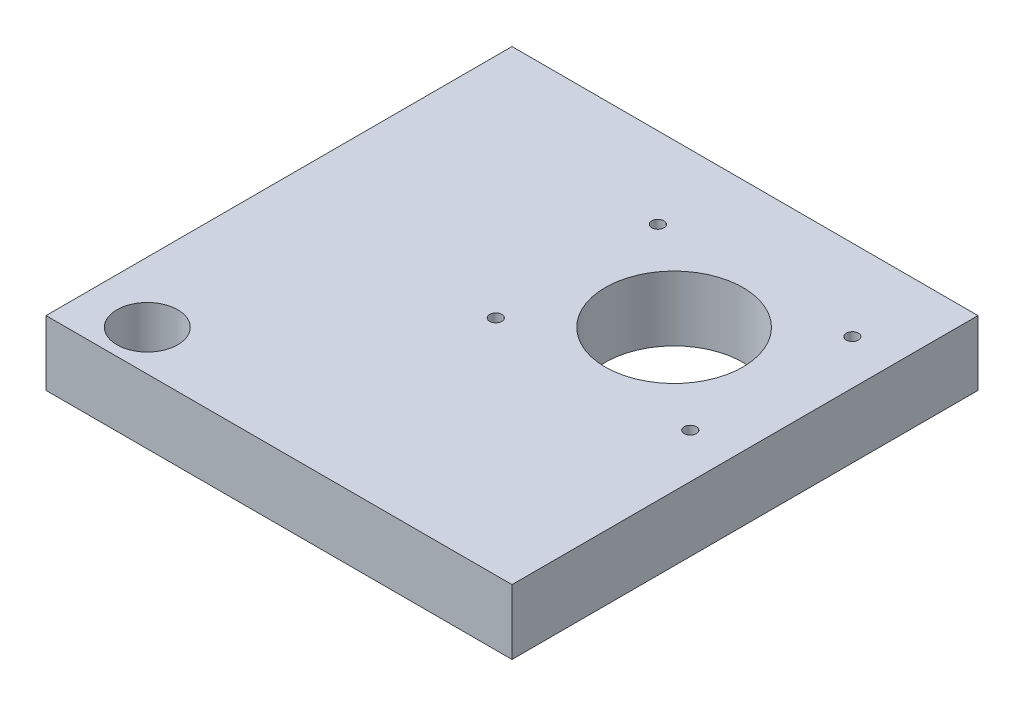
ISO-10303-21;
HEADER;
FILE_DESCRIPTION(('STEP AP214'),'2;1');
FILE_NAME('part.step','',(''),(''),'','','');
FILE_SCHEMA(('AUTOMOTIVE_DESIGN { 1 0 10303 214 1 1 1 1 }'));
ENDSEC;
DATA;
#1=APPLICATION_CONTEXT('core data for automotive mechanical design processes');
#2=APPLICATION_PROTOCOL_DEFINITION('international standard','automotive_design',2000,#1);
#3=PRODUCT_CONTEXT('',#1,'mechanical');
#4=PRODUCT('Part','Part','',(#3));
#5=PRODUCT_RELATED_PRODUCT_CATEGORY('part','',(#4));
#6=PRODUCT_DEFINITION_FORMATION('','',#4);
#7=PRODUCT_DEFINITION_CONTEXT('part definition',#1,'design');
#8=PRODUCT_DEFINITION('design','',#6,#7);
#9=PRODUCT_DEFINITION_SHAPE('','',#8);
#10=(LENGTH_UNIT() NAMED_UNIT(*) SI_UNIT(.MILLI.,.METRE.));
#11=(NAMED_UNIT(*) PLANE_ANGLE_UNIT() SI_UNIT($,.RADIAN.));
#12=(NAMED_UNIT(*) SI_UNIT($,.STERADIAN.) SOLID_ANGLE_UNIT());
#13=UNCERTAINTY_MEASURE_WITH_UNIT(LENGTH_MEASURE(1.E-05),#10,'distance_accuracy_value','');
#14=(GEOMETRIC_REPRESENTATION_CONTEXT(3) GLOBAL_UNCERTAINTY_ASSIGNED_CONTEXT((#13)) GLOBAL_UNIT_ASSIGNED_CONTEXT((#10,
#11,#12)) REPRESENTATION_CONTEXT('',''));
#15=CARTESIAN_POINT('',(0.,0.,0.));
#16=DIRECTION('',(0.,0.,1.));
#17=DIRECTION('',(1.,0.,0.));
#18=AXIS2_PLACEMENT_3D('',#15,#16,#17);
#19=CARTESIAN_POINT('',(0.,0.,115.));
#20=DIRECTION('',(1.,0.,0.));
#21=DIRECTION('',(0.,0.,-1.));
#22=AXIS2_PLACEMENT_3D('',#19,#20,#21);
#23=PLANE('',#22);
#24=DIRECTION('',(0.,-1.,0.));
#25=VECTOR('',#24,1.);
#26=CARTESIAN_POINT('',(0.,0.,0.));
#27=LINE('',#26,#25);
#28=CARTESIAN_POINT('',(0.,16.,0.));
#29=VERTEX_POINT('',#28);
#30=CARTESIAN_POINT('',(0.,0.,0.));
#31=VERTEX_POINT('',#30);
#32=EDGE_CURVE('E68',#29,#31,#27,.T.);
#33=ORIENTED_EDGE('',*,*,#32,.T.);
#34=DIRECTION('',(0.,0.,-1.));
#35=VECTOR('',#34,1.);
#36=CARTESIAN_POINT('',(0.,0.,115.));
#37=LINE('',#36,#35);
#38=CARTESIAN_POINT('',(0.,0.,115.));
#39=VERTEX_POINT('',#38);
#40=EDGE_CURVE('E11',#39,#31,#37,.T.);
#41=ORIENTED_EDGE('',*,*,#40,.F.);
#42=DIRECTION('',(0.,-1.,0.));
#43=VECTOR('',#42,1.);
#44=CARTESIAN_POINT('',(0.,0.,115.));
#45=LINE('',#44,#43);
#46=CARTESIAN_POINT('',(0.,16.,115.));
#47=VERTEX_POINT('',#46);
#48=EDGE_CURVE('E91',#47,#39,#45,.T.);
#49=ORIENTED_EDGE('',*,*,#48,.F.);
#50=DIRECTION('',(0.,0.,-1.));
#51=VECTOR('',#50,1.);
#52=CARTESIAN_POINT('',(0.,16.,115.));
#53=LINE('',#52,#51);
#54=EDGE_CURVE('E80',#47,#29,#53,.T.);
#55=ORIENTED_EDGE('',*,*,#54,.T.);
#56=EDGE_LOOP('',(#33,#41,#49,#55));
#57=FACE_BOUND('',#56,.T.);
#58=ADVANCED_FACE('F24',(#57),#23,.F.);
#59=CARTESIAN_POINT('',(0.,0.,115.));
#60=DIRECTION('',(0.,1.,0.));
#61=DIRECTION('',(0.,0.,1.));
#62=AXIS2_PLACEMENT_3D('',#59,#60,#61);
#63=PLANE('',#62);
#64=CARTESIAN_POINT('',(15.,0.,105.));
#65=DIRECTION('',(0.,1.,0.));
#66=DIRECTION('',(0.,0.,1.));
#67=AXIS2_PLACEMENT_3D('',#64,#65,#66);
#68=CIRCLE('',#67,7.50000000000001);
#69=CARTESIAN_POINT('',(15.,0.,112.5));
#70=VERTEX_POINT('',#69);
#71=EDGE_CURVE('E126',#70,#70,#68,.T.);
#72=ORIENTED_EDGE('',*,*,#71,.T.);
#73=EDGE_LOOP('',(#72));
#74=FACE_BOUND('',#73,.T.);
#75=CARTESIAN_POINT('',(56.,0.,20.));
#76=DIRECTION('',(0.,1.,0.));
#77=DIRECTION('',(0.,0.,1.));
#78=AXIS2_PLACEMENT_3D('',#75,#76,#77);
#79=CIRCLE('',#78,1.5);
#80=CARTESIAN_POINT('',(56.,0.,21.5));
#81=VERTEX_POINT('',#80);
#82=EDGE_CURVE('E130',#81,#81,#79,.T.);
#83=ORIENTED_EDGE('',*,*,#82,.T.);
#84=EDGE_LOOP('',(#83));
#85=FACE_BOUND('',#84,.T.);
#86=CARTESIAN_POINT('',(56.,0.,60.));
#87=DIRECTION('',(0.,1.,0.));
#88=DIRECTION('',(0.,0.,1.));
#89=AXIS2_PLACEMENT_3D('',#86,#87,#88);
#90=CIRCLE('',#89,1.5);
#91=CARTESIAN_POINT('',(56.,0.,61.5));
#92=VERTEX_POINT('',#91);
#93=EDGE_CURVE('E134',#92,#92,#90,.T.);
#94=ORIENTED_EDGE('',*,*,#93,.T.);
#95=EDGE_LOOP('',(#94));
#96=FACE_BOUND('',#95,.T.);
#97=CARTESIAN_POINT('',(104.,0.,60.));
#98=DIRECTION('',(0.,1.,0.));
#99=DIRECTION('',(0.,0.,1.));
#100=AXIS2_PLACEMENT_3D('',#97,#98,#99);
#101=CIRCLE('',#100,1.5);
#102=CARTESIAN_POINT('',(104.,0.,61.5));
#103=VERTEX_POINT('',#102);
#104=EDGE_CURVE('E138',#103,#103,#101,.T.);
#105=ORIENTED_EDGE('',*,*,#104,.T.);
#106=EDGE_LOOP('',(#105));
#107=FACE_BOUND('',#106,.T.);
#108=CARTESIAN_POINT('',(104.,0.,20.));
#109=DIRECTION('',(0.,1.,0.));
#110=DIRECTION('',(0.,0.,1.));
#111=AXIS2_PLACEMENT_3D('',#108,#109,#110);
#112=CIRCLE('',#111,1.5);
#113=CARTESIAN_POINT('',(104.,0.,21.5));
#114=VERTEX_POINT('',#113);
#115=EDGE_CURVE('E142',#114,#114,#112,.T.);
#116=ORIENTED_EDGE('',*,*,#115,.T.);
#117=EDGE_LOOP('',(#116));
#118=FACE_BOUND('',#117,.T.);
#119=CARTESIAN_POINT('',(80.,0.,40.));
#120=DIRECTION('',(0.,1.,0.));
#121=DIRECTION('',(0.,0.,1.));
#122=AXIS2_PLACEMENT_3D('',#119,#120,#121);
#123=CIRCLE('',#122,17.);
#124=CARTESIAN_POINT('',(80.,0.,57.));
#125=VERTEX_POINT('',#124);
#126=EDGE_CURVE('E81',#125,#125,#123,.T.);
#127=ORIENTED_EDGE('',*,*,#126,.T.);
#128=EDGE_LOOP('',(#127));
#129=FACE_BOUND('',#128,.T.);
#130=DIRECTION('',(1.,0.,0.));
#131=VECTOR('',#130,1.);
#132=CARTESIAN_POINT('',(0.,0.,0.));
#133=LINE('',#132,#131);
#134=CARTESIAN_POINT('',(115.,0.,0.));
#135=VERTEX_POINT('',#134);
#136=EDGE_CURVE('E64',#31,#135,#133,.T.);
#137=ORIENTED_EDGE('',*,*,#136,.T.);
#138=DIRECTION('',(0.,0.,-1.));
#139=VECTOR('',#138,1.);
#140=CARTESIAN_POINT('',(115.,0.,115.));
#141=LINE('',#140,#139);
#142=CARTESIAN_POINT('',(115.,0.,115.));
#143=VERTEX_POINT('',#142);
#144=EDGE_CURVE('E31',#143,#135,#141,.T.);
#145=ORIENTED_EDGE('',*,*,#144,.F.);
#146=DIRECTION('',(1.,0.,0.));
#147=VECTOR('',#146,1.);
#148=CARTESIAN_POINT('',(0.,0.,115.));
#149=LINE('',#148,#147);
#150=EDGE_CURVE('E76',#39,#143,#149,.T.);
#151=ORIENTED_EDGE('',*,*,#150,.F.);
#152=ORIENTED_EDGE('',*,*,#40,.T.);
#153=EDGE_LOOP('',(#137,#145,#151,#152));
#154=FACE_BOUND('',#153,.T.);
#155=ADVANCED_FACE('F75',(#74,#85,#96,#107,#118,#129,#154),#63,.F.);
#156=CARTESIAN_POINT('',(115.,0.,115.));
#157=DIRECTION('',(-1.,0.,0.));
#158=DIRECTION('',(0.,0.,1.));
#159=AXIS2_PLACEMENT_3D('',#156,#157,#158);
#160=PLANE('',#159);
#161=DIRECTION('',(0.,1.,0.));
#162=VECTOR('',#161,1.);
#163=CARTESIAN_POINT('',(115.,0.,0.));
#164=LINE('',#163,#162);
#165=CARTESIAN_POINT('',(115.,16.,0.));
#166=VERTEX_POINT('',#165);
#167=EDGE_CURVE('E69',#135,#166,#164,.T.);
#168=ORIENTED_EDGE('',*,*,#167,.T.);
#169=DIRECTION('',(0.,0.,-1.));
#170=VECTOR('',#169,1.);
#171=CARTESIAN_POINT('',(115.,16.,115.));
#172=LINE('',#171,#170);
#173=CARTESIAN_POINT('',(115.,16.,115.));
#174=VERTEX_POINT('',#173);
#175=EDGE_CURVE('E97',#174,#166,#172,.T.);
#176=ORIENTED_EDGE('',*,*,#175,.F.);
#177=DIRECTION('',(0.,1.,0.));
#178=VECTOR('',#177,1.);
#179=CARTESIAN_POINT('',(115.,0.,115.));
#180=LINE('',#179,#178);
#181=EDGE_CURVE('E43',#143,#174,#180,.T.);
#182=ORIENTED_EDGE('',*,*,#181,.F.);
#183=ORIENTED_EDGE('',*,*,#144,.T.);
#184=EDGE_LOOP('',(#168,#176,#182,#183));
#185=FACE_BOUND('',#184,.T.);
#186=ADVANCED_FACE('F100',(#185),#160,.F.);
#187=CARTESIAN_POINT('',(0.,16.,115.));
#188=DIRECTION('',(0.,-1.,0.));
#189=DIRECTION('',(0.,0.,-1.));
#190=AXIS2_PLACEMENT_3D('',#187,#188,#189);
#191=PLANE('',#190);
#192=CARTESIAN_POINT('',(15.,16.,105.));
#193=DIRECTION('',(0.,1.,0.));
#194=DIRECTION('',(0.,0.,1.));
#195=AXIS2_PLACEMENT_3D('',#192,#193,#194);
#196=CIRCLE('',#195,7.50000000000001);
#197=CARTESIAN_POINT('',(15.,16.,112.5));
#198=VERTEX_POINT('',#197);
#199=EDGE_CURVE('E170',#198,#198,#196,.T.);
#200=ORIENTED_EDGE('',*,*,#199,.F.);
#201=EDGE_LOOP('',(#200));
#202=FACE_BOUND('',#201,.T.);
#203=CARTESIAN_POINT('',(56.,16.,20.));
#204=DIRECTION('',(0.,1.,0.));
#205=DIRECTION('',(0.,0.,1.));
#206=AXIS2_PLACEMENT_3D('',#203,#204,#205);
#207=CIRCLE('',#206,1.5);
#208=CARTESIAN_POINT('',(56.,16.,21.5));
#209=VERTEX_POINT('',#208);
#210=EDGE_CURVE('E166',#209,#209,#207,.T.);
#211=ORIENTED_EDGE('',*,*,#210,.F.);
#212=EDGE_LOOP('',(#211));
#213=FACE_BOUND('',#212,.T.);
#214=CARTESIAN_POINT('',(56.,16.,60.));
#215=DIRECTION('',(0.,1.,0.));
#216=DIRECTION('',(0.,0.,1.));
#217=AXIS2_PLACEMENT_3D('',#214,#215,#216);
#218=CIRCLE('',#217,1.5);
#219=CARTESIAN_POINT('',(56.,16.,61.5));
#220=VERTEX_POINT('',#219);
#221=EDGE_CURVE('E162',#220,#220,#218,.T.);
#222=ORIENTED_EDGE('',*,*,#221,.F.);
#223=EDGE_LOOP('',(#222));
#224=FACE_BOUND('',#223,.T.);
#225=CARTESIAN_POINT('',(104.,16.,60.));
#226=DIRECTION('',(0.,1.,0.));
#227=DIRECTION('',(0.,0.,1.));
#228=AXIS2_PLACEMENT_3D('',#225,#226,#227);
#229=CIRCLE('',#228,1.5);
#230=CARTESIAN_POINT('',(104.,16.,61.5));
#231=VERTEX_POINT('',#230);
#232=EDGE_CURVE('E158',#231,#231,#229,.T.);
#233=ORIENTED_EDGE('',*,*,#232,.F.);
#234=EDGE_LOOP('',(#233));
#235=FACE_BOUND('',#234,.T.);
#236=CARTESIAN_POINT('',(104.,16.,20.));
#237=DIRECTION('',(0.,1.,0.));
#238=DIRECTION('',(0.,0.,1.));
#239=AXIS2_PLACEMENT_3D('',#236,#237,#238);
#240=CIRCLE('',#239,1.5);
#241=CARTESIAN_POINT('',(104.,16.,21.5));
#242=VERTEX_POINT('',#241);
#243=EDGE_CURVE('E152',#242,#242,#240,.T.);
#244=ORIENTED_EDGE('',*,*,#243,.F.);
#245=EDGE_LOOP('',(#244));
#246=FACE_BOUND('',#245,.T.);
#247=CARTESIAN_POINT('',(80.,16.,40.));
#248=DIRECTION('',(0.,1.,0.));
#249=DIRECTION('',(0.,0.,1.));
#250=AXIS2_PLACEMENT_3D('',#247,#248,#249);
#251=CIRCLE('',#250,17.);
#252=CARTESIAN_POINT('',(80.,16.,57.));
#253=VERTEX_POINT('',#252);
#254=EDGE_CURVE('E84',#253,#253,#251,.T.);
#255=ORIENTED_EDGE('',*,*,#254,.F.);
#256=EDGE_LOOP('',(#255));
#257=FACE_BOUND('',#256,.T.);
#258=DIRECTION('',(-1.,0.,0.));
#259=VECTOR('',#258,1.);
#260=CARTESIAN_POINT('',(0.,16.,0.));
#261=LINE('',#260,#259);
#262=EDGE_CURVE('E89',#166,#29,#261,.T.);
#263=ORIENTED_EDGE('',*,*,#262,.T.);
#264=ORIENTED_EDGE('',*,*,#54,.F.);
#265=DIRECTION('',(-1.,0.,0.));
#266=VECTOR('',#265,1.);
#267=CARTESIAN_POINT('',(0.,16.,115.));
#268=LINE('',#267,#266);
#269=EDGE_CURVE('E38',#174,#47,#268,.T.);
#270=ORIENTED_EDGE('',*,*,#269,.F.);
#271=ORIENTED_EDGE('',*,*,#175,.T.);
#272=EDGE_LOOP('',(#263,#264,#270,#271));
#273=FACE_BOUND('',#272,.T.);
#274=ADVANCED_FACE('F102',(#202,#213,#224,#235,#246,#257,#273),#191,.F.);
#275=CARTESIAN_POINT('',(0.,16.,115.));
#276=DIRECTION('',(0.,0.,-1.));
#277=DIRECTION('',(-1.,0.,0.));
#278=AXIS2_PLACEMENT_3D('',#275,#276,#277);
#279=PLANE('',#278);
#280=ORIENTED_EDGE('',*,*,#48,.T.);
#281=ORIENTED_EDGE('',*,*,#150,.T.);
#282=ORIENTED_EDGE('',*,*,#181,.T.);
#283=ORIENTED_EDGE('',*,*,#269,.T.);
#284=EDGE_LOOP('',(#280,#281,#282,#283));
#285=FACE_BOUND('',#284,.T.);
#286=ADVANCED_FACE('F103',(#285),#279,.F.);
#287=CARTESIAN_POINT('',(0.,16.,0.));
#288=DIRECTION('',(0.,0.,-1.));
#289=DIRECTION('',(-1.,0.,0.));
#290=AXIS2_PLACEMENT_3D('',#287,#288,#289);
#291=PLANE('',#290);
#292=ORIENTED_EDGE('',*,*,#32,.F.);
#293=ORIENTED_EDGE('',*,*,#262,.F.);
#294=ORIENTED_EDGE('',*,*,#167,.F.);
#295=ORIENTED_EDGE('',*,*,#136,.F.);
#296=EDGE_LOOP('',(#292,#293,#294,#295));
#297=FACE_BOUND('',#296,.T.);
#298=ADVANCED_FACE('F65',(#297),#291,.T.);
#299=CARTESIAN_POINT('',(80.,0.,40.));
#300=DIRECTION('',(0.,1.,0.));
#301=DIRECTION('',(0.,0.,1.));
#302=AXIS2_PLACEMENT_3D('',#299,#300,#301);
#303=CYLINDRICAL_SURFACE('',#302,17.);
#304=ORIENTED_EDGE('',*,*,#126,.F.);
#305=EDGE_LOOP('',(#304));
#306=FACE_BOUND('',#305,.T.);
#307=ORIENTED_EDGE('',*,*,#254,.T.);
#308=EDGE_LOOP('',(#307));
#309=FACE_BOUND('',#308,.T.);
#310=ADVANCED_FACE('F110',(#306,#309),#303,.F.);
#311=CARTESIAN_POINT('',(104.,0.,20.));
#312=DIRECTION('',(0.,1.,0.));
#313=DIRECTION('',(0.,0.,1.));
#314=AXIS2_PLACEMENT_3D('',#311,#312,#313);
#315=CYLINDRICAL_SURFACE('',#314,1.5);
#316=ORIENTED_EDGE('',*,*,#115,.F.);
#317=EDGE_LOOP('',(#316));
#318=FACE_BOUND('',#317,.T.);
#319=ORIENTED_EDGE('',*,*,#243,.T.);
#320=EDGE_LOOP('',(#319));
#321=FACE_BOUND('',#320,.T.);
#322=ADVANCED_FACE('F147',(#318,#321),#315,.F.);
#323=CARTESIAN_POINT('',(104.,0.,60.));
#324=DIRECTION('',(0.,1.,0.));
#325=DIRECTION('',(0.,0.,1.));
#326=AXIS2_PLACEMENT_3D('',#323,#324,#325);
#327=CYLINDRICAL_SURFACE('',#326,1.5);
#328=ORIENTED_EDGE('',*,*,#104,.F.);
#329=EDGE_LOOP('',(#328));
#330=FACE_BOUND('',#329,.T.);
#331=ORIENTED_EDGE('',*,*,#232,.T.);
#332=EDGE_LOOP('',(#331));
#333=FACE_BOUND('',#332,.T.);
#334=ADVANCED_FACE('F185',(#330,#333),#327,.F.);
#335=CARTESIAN_POINT('',(56.,0.,60.));
#336=DIRECTION('',(0.,1.,0.));
#337=DIRECTION('',(0.,0.,1.));
#338=AXIS2_PLACEMENT_3D('',#335,#336,#337);
#339=CYLINDRICAL_SURFACE('',#338,1.5);
#340=ORIENTED_EDGE('',*,*,#93,.F.);
#341=EDGE_LOOP('',(#340));
#342=FACE_BOUND('',#341,.T.);
#343=ORIENTED_EDGE('',*,*,#221,.T.);
#344=EDGE_LOOP('',(#343));
#345=FACE_BOUND('',#344,.T.);
#346=ADVANCED_FACE('F191',(#342,#345),#339,.F.);
#347=CARTESIAN_POINT('',(56.,0.,20.));
#348=DIRECTION('',(0.,1.,0.));
#349=DIRECTION('',(0.,0.,1.));
#350=AXIS2_PLACEMENT_3D('',#347,#348,#349);
#351=CYLINDRICAL_SURFACE('',#350,1.5);
#352=ORIENTED_EDGE('',*,*,#82,.F.);
#353=EDGE_LOOP('',(#352));
#354=FACE_BOUND('',#353,.T.);
#355=ORIENTED_EDGE('',*,*,#210,.T.);
#356=EDGE_LOOP('',(#355));
#357=FACE_BOUND('',#356,.T.);
#358=ADVANCED_FACE('F197',(#354,#357),#351,.F.);
#359=CARTESIAN_POINT('',(15.,0.,105.));
#360=DIRECTION('',(0.,1.,0.));
#361=DIRECTION('',(0.,0.,1.));
#362=AXIS2_PLACEMENT_3D('',#359,#360,#361);
#363=CYLINDRICAL_SURFACE('',#362,7.50000000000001);
#364=ORIENTED_EDGE('',*,*,#71,.F.);
#365=EDGE_LOOP('',(#364));
#366=FACE_BOUND('',#365,.T.);
#367=ORIENTED_EDGE('',*,*,#199,.T.);
#368=EDGE_LOOP('',(#367));
#369=FACE_BOUND('',#368,.T.);
#370=ADVANCED_FACE('F174',(#366,#369),#363,.F.);
#371=CLOSED_SHELL('',(#58,#155,#186,#274,#286,#298,#310,#322,#334,#346,#358,#370));
#372=MANIFOLD_SOLID_BREP('B2',#371);
#373=ADVANCED_BREP_SHAPE_REPRESENTATION('',(#18,#372),#14);
#374=SHAPE_DEFINITION_REPRESENTATION(#9,#373);
ENDSEC;
END-ISO-10303-21;
